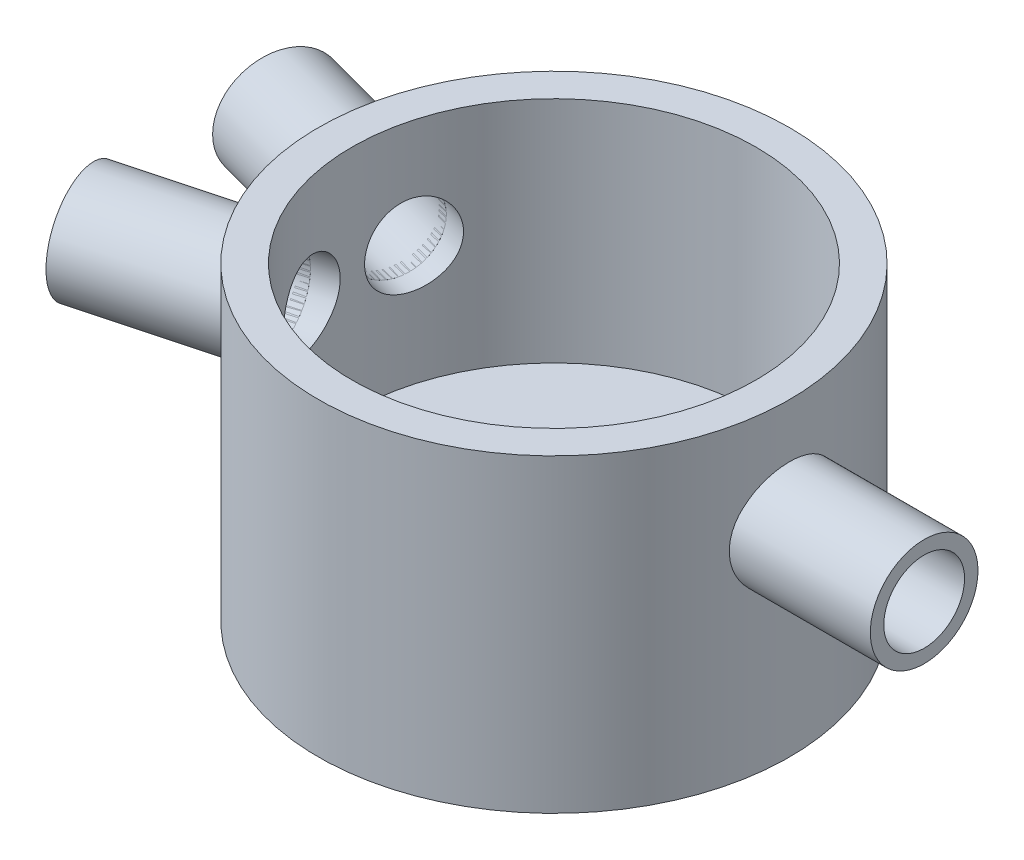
from build123d import *

# Parameters (mm, degrees)
FUROS_GUIA_COM_6_0MM1_D       = 6
FUROS_GUIA_COM_6_0MM1_DEPTH   = 5
FUROS_GUIA_COM_6_0MM1_TIP     = 1.802581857
FUROS_GUIA_COM_6_0MM5_D       = 6
FUROS_GUIA_COM_6_0MM5_DEPTH   = 5
FUROS_GUIA_COM_6_0MM5_TIP     = 1.802581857
FUROS_GUIA_COM_6_0MM4_D       = 6
FUROS_GUIA_COM_6_0MM4_DEPTH   = 5
FUROS_GUIA_COM_6_0MM4_TIP     = 1.802581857
RESSALTO_EXTRUS_O1_DEPTH      = 11.432571
RESSALTO_EXTRUS_O1_DEPTH_BACK = 1
ESBO_O9_R                     = 4
ESBO_O9_R_2                   = 3
RESSALTO_EXTRUS_O2_DEPTH      = 11
RESSALTO_EXTRUS_O2_DEPTH_BACK = 1
ESBO_O11_R                    = 4
ESBO_O11_R_2                  = 3
RESSALTO_EXTRUS_O3_DEPTH      = 10
RESSALTO_EXTRUS_O3_DEPTH_BACK = 1
ESBO_O13_R                    = 4
ESBO_O13_R_2                  = 3


with BuildPart() as part:
    # Esbo_o1 → Revolu_o1 (revolve)
    with BuildSketch(Plane.XY, mode=Mode.PRIVATE) as revolu_o1_sk:
        Polygon((0, -15), (17.5, -15), (17.5, 8), (15, 8), (15, -9), (5, -9), (5, -11.5), (3.25, -11.5), (3.25, -12.5), (0, -12.5), align=None)
    revolve(revolu_o1_sk.sketch.rotate(Axis((0, 0, 0), (0, 1, 0)), 90), axis=Axis((0, 0, 0), (0, 1, 0)))

    # Furos-guia com _6.0mm1
    with Locations(Plane(origin=(17.5, 0, 0), x_dir=(0, 0, 1), z_dir=(1, 0, 0))):
        with Locations((0, 0)):
            Hole(FUROS_GUIA_COM_6_0MM1_D / 2, depth=FUROS_GUIA_COM_6_0MM1_DEPTH)
            with Locations((0, 0, -(FUROS_GUIA_COM_6_0MM1_DEPTH + FUROS_GUIA_COM_6_0MM1_TIP / 2))):  # 118° drill point
                Cone(0, FUROS_GUIA_COM_6_0MM1_D / 2, FUROS_GUIA_COM_6_0MM1_TIP, mode=Mode.SUBTRACT)

    # Furos-guia com _6.0mm5
    with Locations(Plane(origin=(-16.90370196, 0, -4.529333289), x_dir=(0.258819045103, 0, -0.965925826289), z_dir=(-0.965925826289, 0, -0.258819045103))):
        with Locations((0, 0)):
            Hole(FUROS_GUIA_COM_6_0MM5_D / 2, depth=FUROS_GUIA_COM_6_0MM5_DEPTH)
            with Locations((0, 0, -(FUROS_GUIA_COM_6_0MM5_DEPTH + FUROS_GUIA_COM_6_0MM5_TIP / 2))):  # 118° drill point
                Cone(0, FUROS_GUIA_COM_6_0MM5_D / 2, FUROS_GUIA_COM_6_0MM5_TIP, mode=Mode.SUBTRACT)

    # Furos-guia com _6.0mm4
    with Locations(Plane(origin=(-16.90370196, 0, 4.529333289), x_dir=(-0.258819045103, 0, -0.965925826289), z_dir=(-0.965925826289, 0, 0.258819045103))):
        with Locations((0, 0)):
            Hole(FUROS_GUIA_COM_6_0MM4_D / 2, depth=FUROS_GUIA_COM_6_0MM4_DEPTH)
            with Locations((0, 0, -(FUROS_GUIA_COM_6_0MM4_DEPTH + FUROS_GUIA_COM_6_0MM4_TIP / 2))):  # 118° drill point
                Cone(0, FUROS_GUIA_COM_6_0MM4_D / 2, FUROS_GUIA_COM_6_0MM4_TIP, mode=Mode.SUBTRACT)


with BuildPart() as body_2:
    # Esbo_o9 → Ressalto-extrus_o1 (new, two sides: drawn at the far end of the back side and taken through both)
    with BuildSketch(Plane(origin=(-16.90370196, 0, -4.529333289), x_dir=(0, -1, 0), z_dir=(-0.9659258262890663, 0, -0.25881904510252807)).offset(-RESSALTO_EXTRUS_O1_DEPTH_BACK)):
        with Locations(Location((0, 0, 0), (0, 0, 90))):
            Circle(ESBO_O9_R)
        with Locations(Location((0, 0, 0), (0, 0, 90))):
            Circle(ESBO_O9_R_2, mode=Mode.SUBTRACT)
    extrude(amount=RESSALTO_EXTRUS_O1_DEPTH + RESSALTO_EXTRUS_O1_DEPTH_BACK)


with BuildPart() as body_3:
    # Esbo_o11 → Ressalto-extrus_o2 (new, two sides: drawn at the far end of the back side and taken through both)
    with BuildSketch(Plane(origin=(-16.90370196, 0, 4.529333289), x_dir=(0, -1, 0), z_dir=(-0.96592582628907, 0, 0.2588190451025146)).offset(-RESSALTO_EXTRUS_O2_DEPTH_BACK)):
        with Locations(Location((0, 0, 0), (0, 0, 90))):
            Circle(ESBO_O11_R)
        with Locations(Location((0, 0, 0), (0, 0, 90))):
            Circle(ESBO_O11_R_2, mode=Mode.SUBTRACT)
    extrude(amount=RESSALTO_EXTRUS_O2_DEPTH + RESSALTO_EXTRUS_O2_DEPTH_BACK)


with BuildPart() as body_4:
    # Esbo_o13 → Ressalto-extrus_o3 (new, two sides: drawn at the far end of the back side and taken through both)
    with BuildSketch(Plane(origin=(17.5, 0, 0), x_dir=(0, -1, 0), z_dir=(1, 0, 0)).offset(-RESSALTO_EXTRUS_O3_DEPTH_BACK)):
        with Locations(Location((0, 0, 0), (0, 0, 90))):
            Circle(ESBO_O13_R)
        with Locations(Location((0, 0, 0), (0, 0, 90))):
            Circle(ESBO_O13_R_2, mode=Mode.SUBTRACT)
    extrude(amount=RESSALTO_EXTRUS_O3_DEPTH + RESSALTO_EXTRUS_O3_DEPTH_BACK)


solid = Compound([part.part, body_2.part, body_3.part, body_4.part])
